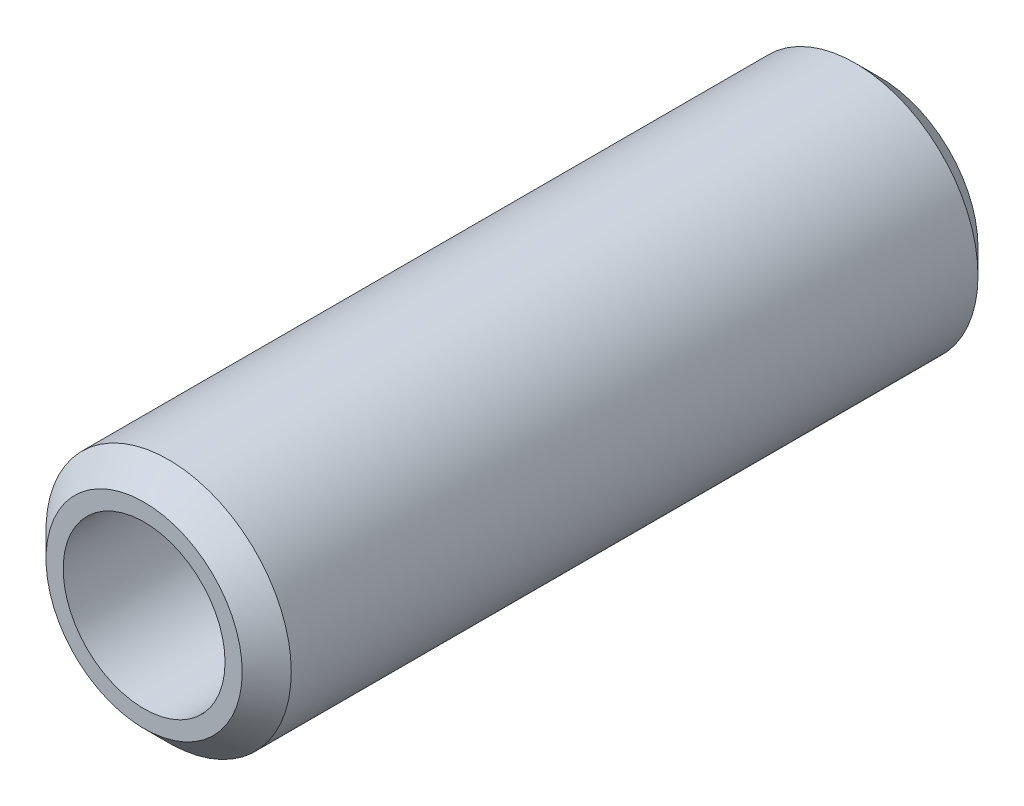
from build123d import *

# Parameters (mm, degrees)
ESQUISSE1_R       = 2.5
EXTRUSION1_DEPTH  = 15
CHANFREIN1_SIZE   = 0.5
TROU_TARAUD_M41_D = 3.3


with BuildPart() as part:
    # Esquisse1 → Extrusion1 (new body)
    with BuildSketch(Plane.XY):
        Circle(ESQUISSE1_R)
    extrude(amount=EXTRUSION1_DEPTH)

    # Chanfrein1
    chanfrein1_edges = [part.edges().sort_by_distance(p)[0] for p in [
        (-2.5, 0, 0),
        (-2.5, 0, 15),
    ]]
    chamfer(chanfrein1_edges, length=CHANFREIN1_SIZE)

    # Trou taraud_ M41 (through all)
    with Locations(Plane.XY.offset(15)):
        with Locations((0, 0)):
            Hole(TROU_TARAUD_M41_D / 2)


solid = part.part
